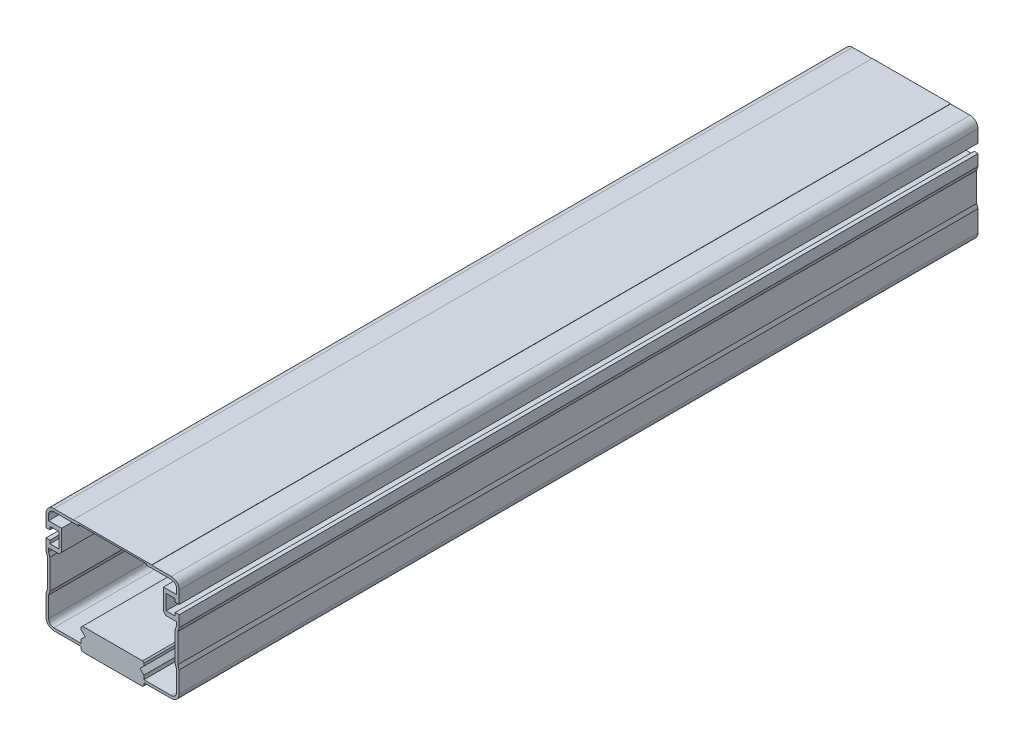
from build123d import *

# Parameters (mm, degrees)
EXTRUDE_1_DEPTH        = 306
HOLE_WIZARD_M5_2_D     = 4.2
HOLE_WIZARD_M5_2_DEPTH = 14.4
HOLE_WIZARD_M5_2_TIP   = 1.2618073


with BuildPart() as part:
    # Sketch 1 → Extrude 1 (new body)
    with BuildSketch(Plane.XY):
        with BuildLine():
            Line((22.5, 42), (15, 42))
            Line((15, 42), (15, 42.1))
            Line((15, 42.1), (-15, 42.1))
            Line((-15, 42.1), (-15, 42))
            Line((-15, 42), (-22.5, 42))
            ThreePointArc((-22.5, 42), (-24.621320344, 41.121320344), (-25.5, 39))
            Line((-25.5, 39), (-25.5, 34.2))
            Line((-25.5, 34.2), (-24, 34.2))
            Line((-24, 34.2), (-24, 35.4))
            Line((-24, 35.4), (-20.5, 35.4))
            Line((-20.5, 35.4), (-20.5, 29.6))
            Line((-20.5, 29.6), (-24, 29.6))
            Line((-24, 29.6), (-24, 30.8))
            Line((-24, 30.8), (-25.5, 30.8))
            Line((-25.5, 30.8), (-25.5, 26.5))
            Line((-25.5, 26.5), (-25, 25))
            Line((-25, 25), (-25, 14))
            Line((-25, 14), (-25.5, 12.5))
            Line((-25.5, 12.5), (-25.5, 4.5))
            ThreePointArc((-25.5, 4.5), (-24.621320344, 2.378679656), (-22.5, 1.5))
            Line((-22.5, 1.5), (-12, 1.5))
            Line((-12, 1.5), (-12, 0.5))
            Line((-12, 0.5), (-11.5, 0))
            Line((-11.5, 0), (11.5, 0))
            Line((11.5, 0), (12, 0.5))
            Line((12, 0.5), (12, 1.5))
            Line((12, 1.5), (22.5, 1.5))
            ThreePointArc((22.5, 1.5), (24.621320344, 2.378679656), (25.5, 4.5))
            Line((25.5, 4.5), (25.5, 12.5))
            Line((25.5, 12.5), (25, 14))
            Line((25, 14), (25, 25))
            Line((25, 25), (25.5, 26.5))
            Line((25.5, 26.5), (25.5, 30.8))
            Line((25.5, 30.8), (24, 30.8))
            Line((24, 30.8), (24, 29.6))
            Line((24, 29.6), (20.5, 29.6))
            Line((20.5, 29.6), (20.5, 35.4))
            Line((20.5, 35.4), (24, 35.4))
            Line((24, 35.4), (24, 34.2))
            Line((24, 34.2), (25.5, 34.2))
            Line((25.5, 34.2), (25.5, 39))
            ThreePointArc((25.5, 39), (24.621320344, 41.121320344), (22.5, 42))
        make_face()
        with BuildLine():
            Line((12, 2.5), (22.5, 2.5))
            ThreePointArc((22.5, 2.5), (23.914213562, 3.085786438), (24.5, 4.5))
            Line((24.5, 4.5), (24.5, 12.33772234))
            Line((24.5, 12.33772234), (24, 13.83772234))
            Line((24, 13.83772234), (24, 25.16227766))
            Line((24, 25.16227766), (24.5, 26.66227766))
            Line((24.5, 26.66227766), (24.5, 28))
            Line((24.5, 28), (20.5, 28))
            Line((20.5, 28), (19.5, 29))
            Line((19.5, 29), (19.5, 37))
            Line((19.5, 37), (24.5, 37))
            Line((24.5, 37), (24.5, 39))
            ThreePointArc((24.5, 39), (23.914213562, 40.414213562), (22.5, 41))
            Line((22.5, 41), (13, 41))
            Line((13, 41), (13, 41.5))
            Line((13, 41.5), (-13, 41.5))
            Line((-13, 41.5), (-13, 41))
            Line((-13, 41), (-22.5, 41))
            ThreePointArc((-22.5, 41), (-23.914213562, 40.414213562), (-24.5, 39))
            Line((-24.5, 39), (-24.5, 37))
            Line((-24.5, 37), (-19.5, 37))
            Line((-19.5, 37), (-19.5, 29))
            Line((-19.5, 29), (-20.5, 28))
            Line((-20.5, 28), (-24.5, 28))
            Line((-24.5, 28), (-24.5, 26.66227766))
            Line((-24.5, 26.66227766), (-24, 25.16227766))
            Line((-24, 25.16227766), (-24, 13.83772234))
            Line((-24, 13.83772234), (-24.5, 12.33772234))
            Line((-24.5, 12.33772234), (-24.5, 4.5))
            ThreePointArc((-24.5, 4.5), (-23.914213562, 3.085786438), (-22.5, 2.5))
            Line((-22.5, 2.5), (-12, 2.5))
            Line((-12, 2.5), (-12, 4))
            Line((-12, 4), (-10.5, 5.5))
            Line((-10.5, 5.5), (-12, 7))
            Line((-12, 7), (-12, 8))
            Line((-12, 8), (-11.5, 8.5))
            Line((-11.5, 8.5), (11.5, 8.5))
            Line((11.5, 8.5), (12, 8))
            Line((12, 8), (12, 7))
            Line((12, 7), (10.5, 5.5))
            Line((10.5, 5.5), (12, 4))
            Line((12, 4), (12, 2.5))
        make_face(mode=Mode.SUBTRACT)
    extrude(amount=EXTRUDE_1_DEPTH)

    # Hole Wizard M5 _2
    with Locations(Plane(origin=(0, 0, 0), x_dir=(-1, 0, 0), z_dir=(0, -1, 0))):
        with Locations((0, -263), (0, -223), (0, -183), (0, -143), (0, -103), (0, -63), (0, -23), (0, 17), (0, 57), (0, 97), (0, 137), (0, 177), (0, 217), (0, 257), (0, 297), (0, 337), (0, 377), (0, 417), (0, 457), (0, 497), (0, 537), (0, 617), (0, 577)):
            Hole(HOLE_WIZARD_M5_2_D / 2, depth=HOLE_WIZARD_M5_2_DEPTH)
            with Locations((0, 0, -(HOLE_WIZARD_M5_2_DEPTH + HOLE_WIZARD_M5_2_TIP / 2))):  # 118° drill point
                Cone(0, HOLE_WIZARD_M5_2_D / 2, HOLE_WIZARD_M5_2_TIP, mode=Mode.SUBTRACT)


solid = part.part
